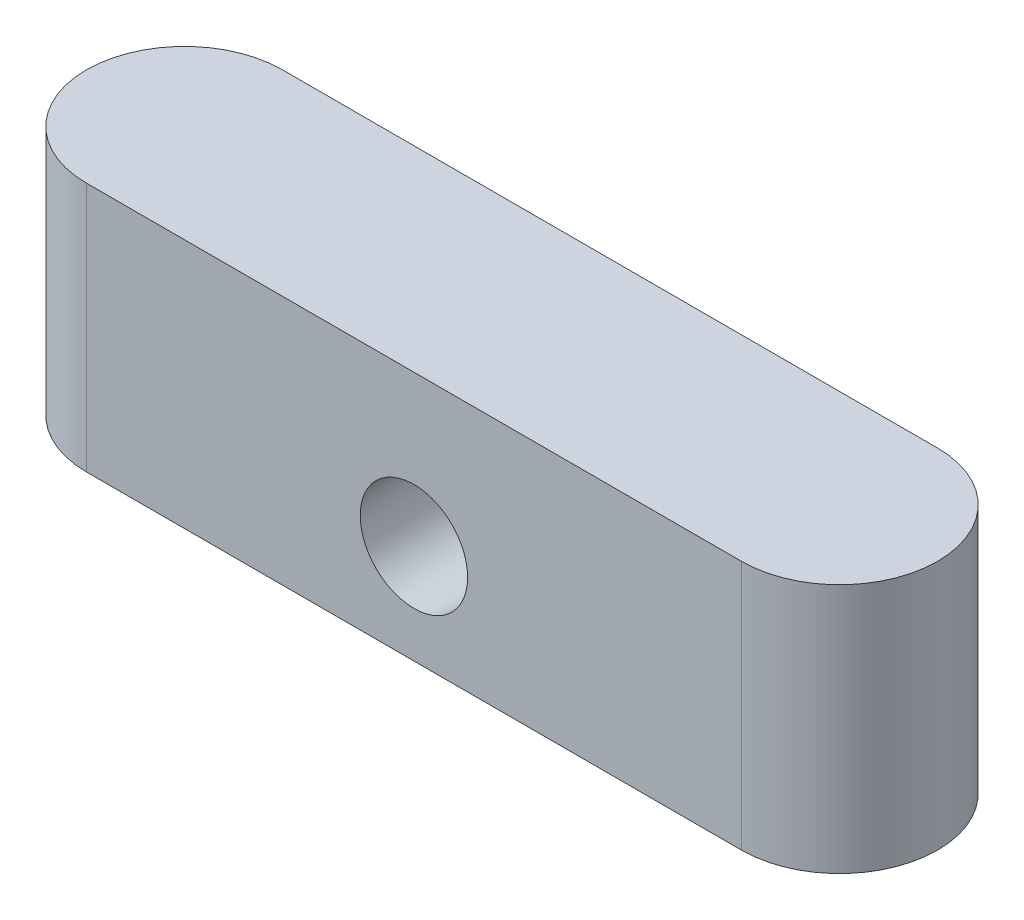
from build123d import *

# Parameters (mm, degrees)
BOSS_EXTRUDE1_DEPTH   = 3.15
F_6_32_TAPPED_HOLE1_D = 2.7051


with BuildPart() as part:
    # Sketch1 → Boss-Extrude1 (new, symmetric)
    with BuildSketch(Plane(origin=(0, 0, 0), x_dir=(1, 0, 0), z_dir=(0, 1, 0))):
        with BuildLine():
            Line((-8.25, 2.47015), (8.25, 2.47015))
            ThreePointArc((8.25, 2.47015), (10.72015, 0), (8.25, -2.47015))
            Line((8.25, -2.47015), (-8.25, -2.47015))
            ThreePointArc((-8.25, -2.47015), (-10.72015, 0), (-8.25, 2.47015))
        make_face()
    extrude(amount=BOSS_EXTRUDE1_DEPTH, both=True)

    # 6-32 Tapped Hole1 (through all)
    with Locations(Plane.XY.offset(2.47015)):
        with Locations((0, -0.65)):
            Hole(F_6_32_TAPPED_HOLE1_D / 2)


solid = part.part
